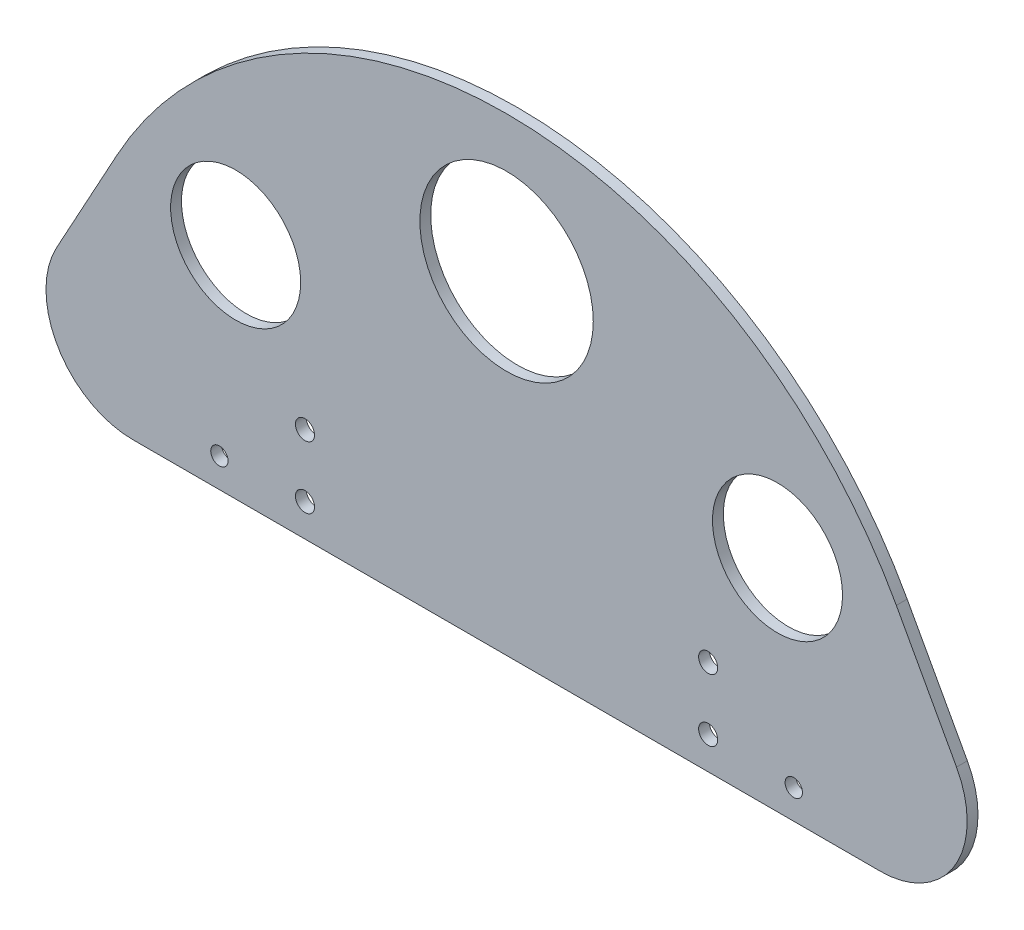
from build123d import *

# Parameters (mm, degrees)
SKETCH1_R          = 38.1
SKETCH1_R_2        = 50.8
SKETCH1_R_3        = 5.588
EXTRUDE1_DEPTH     = 3.175
SKETCH3_R          = 5.08
CUT_EXTRUDE2_DEPTH = 306.725298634


with BuildPart() as part:
    # Sketch1 → Extrude1 (new, symmetric)
    with BuildSketch(Plane.XY):
        with BuildLine():
            Line((-219.075, -131.432917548), (219.075, -131.432917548))
            ThreePointArc((219.075, -131.432917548), (262.777809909, -106.530878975), (263.634593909, -56.238602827))
            Line((263.634593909, -56.238602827), (228.367918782, 8.180862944))
            ThreePointArc((228.367918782, 8.180862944), (0, 143.51), (-228.367918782, 8.180862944))
            Line((-228.367918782, 8.180862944), (-263.634593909, -56.238602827))
            ThreePointArc((-263.634593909, -56.238602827), (-262.777809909, -106.530878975), (-219.075, -131.432917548))
        make_face()
        with Locations((-158.75, -2.54)):
            Circle(SKETCH1_R, mode=Mode.SUBTRACT)
        with Locations((0, 63.5)):
            Circle(SKETCH1_R_2, mode=Mode.SUBTRACT)
        with Locations((158.75, -2.54)):
            Circle(SKETCH1_R, mode=Mode.SUBTRACT)
        with Locations((-118.11, -75.883117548)):
            Circle(SKETCH1_R_3, mode=Mode.SUBTRACT)
        with Locations((-118.11, -112.382917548)):
            Circle(SKETCH1_R_3, mode=Mode.SUBTRACT)
        with Locations((118.11, -75.883117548)):
            Circle(SKETCH1_R_3, mode=Mode.SUBTRACT)
        with Locations((118.11, -112.382917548)):
            Circle(SKETCH1_R_3, mode=Mode.SUBTRACT)
    extrude(amount=EXTRUDE1_DEPTH, both=True)

    # Sketch3 → Cut-Extrude2 (cut, through all)
    with BuildSketch(Plane.XY.offset(3.175)):
        with Locations((168.275, -114.3)):
            Circle(SKETCH3_R)
    cut_extrude2 = extrude(amount=-CUT_EXTRUDE2_DEPTH, mode=Mode.SUBTRACT)

    # Mirror1: Cut-Extrude2 across plane
    add(cut_extrude2.mirror(Plane(origin=(0, 0, 0), x_dir=(0, 0, 1), z_dir=(1, 0, 0))), mode=Mode.SUBTRACT)


solid = part.part
